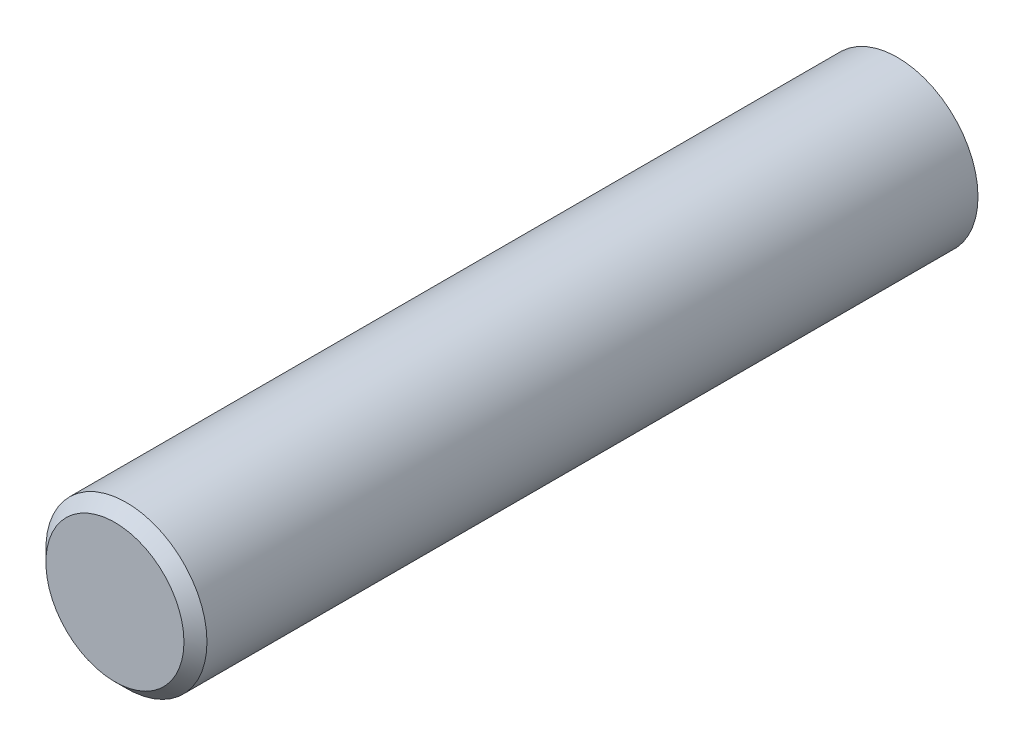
ISO-10303-21;
HEADER;
FILE_DESCRIPTION(('STEP AP214'),'2;1');
FILE_NAME('part.step','',(''),(''),'','','');
FILE_SCHEMA(('AUTOMOTIVE_DESIGN { 1 0 10303 214 1 1 1 1 }'));
ENDSEC;
DATA;
#1=APPLICATION_CONTEXT('core data for automotive mechanical design processes');
#2=APPLICATION_PROTOCOL_DEFINITION('international standard','automotive_design',2000,#1);
#3=PRODUCT_CONTEXT('',#1,'mechanical');
#4=PRODUCT('Part','Part','',(#3));
#5=PRODUCT_RELATED_PRODUCT_CATEGORY('part','',(#4));
#6=PRODUCT_DEFINITION_FORMATION('','',#4);
#7=PRODUCT_DEFINITION_CONTEXT('part definition',#1,'design');
#8=PRODUCT_DEFINITION('design','',#6,#7);
#9=PRODUCT_DEFINITION_SHAPE('','',#8);
#10=(LENGTH_UNIT() NAMED_UNIT(*) SI_UNIT(.MILLI.,.METRE.));
#11=(NAMED_UNIT(*) PLANE_ANGLE_UNIT() SI_UNIT($,.RADIAN.));
#12=(NAMED_UNIT(*) SI_UNIT($,.STERADIAN.) SOLID_ANGLE_UNIT());
#13=UNCERTAINTY_MEASURE_WITH_UNIT(LENGTH_MEASURE(1.E-05),#10,'distance_accuracy_value','');
#14=(GEOMETRIC_REPRESENTATION_CONTEXT(3) GLOBAL_UNCERTAINTY_ASSIGNED_CONTEXT((#13)) GLOBAL_UNIT_ASSIGNED_CONTEXT((#10,
#11,#12)) REPRESENTATION_CONTEXT('',''));
#15=CARTESIAN_POINT('',(0.,0.,0.));
#16=DIRECTION('',(0.,0.,1.));
#17=DIRECTION('',(1.,0.,0.));
#18=AXIS2_PLACEMENT_3D('',#15,#16,#17);
#19=CARTESIAN_POINT('',(0.,0.,34.));
#20=DIRECTION('',(0.,0.,-1.));
#21=DIRECTION('',(-1.,0.,0.));
#22=AXIS2_PLACEMENT_3D('',#19,#20,#21);
#23=CYLINDRICAL_SURFACE('',#22,3.5);
#24=CARTESIAN_POINT('',(0.,0.,33.5));
#25=DIRECTION('',(0.,0.,1.));
#26=DIRECTION('',(1.,0.,0.));
#27=AXIS2_PLACEMENT_3D('',#24,#25,#26);
#28=CIRCLE('',#27,3.5);
#29=CARTESIAN_POINT('',(3.5,0.,33.5));
#30=VERTEX_POINT('',#29);
#31=EDGE_CURVE('E10',#30,#30,#28,.F.);
#32=ORIENTED_EDGE('',*,*,#31,.T.);
#33=EDGE_LOOP('',(#32));
#34=FACE_BOUND('',#33,.T.);
#35=CARTESIAN_POINT('',(0.,0.,0.));
#36=DIRECTION('',(0.,0.,1.));
#37=DIRECTION('',(1.,0.,0.));
#38=AXIS2_PLACEMENT_3D('',#35,#36,#37);
#39=CIRCLE('',#38,3.5);
#40=CARTESIAN_POINT('',(3.5,0.,0.));
#41=VERTEX_POINT('',#40);
#42=EDGE_CURVE('E41',#41,#41,#39,.T.);
#43=ORIENTED_EDGE('',*,*,#42,.T.);
#44=EDGE_LOOP('',(#43));
#45=FACE_BOUND('',#44,.T.);
#46=ADVANCED_FACE('F30',(#34,#45),#23,.T.);
#47=CARTESIAN_POINT('',(0.,0.,34.));
#48=DIRECTION('',(0.,0.,1.));
#49=DIRECTION('',(1.,0.,0.));
#50=AXIS2_PLACEMENT_3D('',#47,#48,#49);
#51=PLANE('',#50);
#52=CARTESIAN_POINT('',(0.,0.,34.));
#53=DIRECTION('',(0.,0.,1.));
#54=DIRECTION('',(1.,0.,0.));
#55=AXIS2_PLACEMENT_3D('',#52,#53,#54);
#56=CIRCLE('',#55,2.99999999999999);
#57=CARTESIAN_POINT('',(2.99999999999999,0.,34.));
#58=VERTEX_POINT('',#57);
#59=EDGE_CURVE('E37',#58,#58,#56,.T.);
#60=ORIENTED_EDGE('',*,*,#59,.T.);
#61=EDGE_LOOP('',(#60));
#62=FACE_BOUND('',#61,.T.);
#63=ADVANCED_FACE('F51',(#62),#51,.T.);
#64=CARTESIAN_POINT('',(0.,0.,0.));
#65=DIRECTION('',(0.,0.,1.));
#66=DIRECTION('',(1.,0.,0.));
#67=AXIS2_PLACEMENT_3D('',#64,#65,#66);
#68=PLANE('',#67);
#69=ORIENTED_EDGE('',*,*,#42,.F.);
#70=EDGE_LOOP('',(#69));
#71=FACE_BOUND('',#70,.T.);
#72=ADVANCED_FACE('F49',(#71),#68,.F.);
#73=CARTESIAN_POINT('',(0.,0.,34.));
#74=DIRECTION('',(0.,0.,-1.));
#75=DIRECTION('',(-1.,0.,0.));
#76=AXIS2_PLACEMENT_3D('',#73,#74,#75);
#77=CONICAL_SURFACE('',#76,2.99999999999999,0.785398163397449);
#78=ORIENTED_EDGE('',*,*,#31,.F.);
#79=EDGE_LOOP('',(#78));
#80=FACE_BOUND('',#79,.T.);
#81=ORIENTED_EDGE('',*,*,#59,.F.);
#82=EDGE_LOOP('',(#81));
#83=FACE_BOUND('',#82,.T.);
#84=ADVANCED_FACE('F32',(#80,#83),#77,.T.);
#85=CLOSED_SHELL('',(#46,#63,#72,#84));
#86=MANIFOLD_SOLID_BREP('B2',#85);
#87=ADVANCED_BREP_SHAPE_REPRESENTATION('',(#18,#86),#14);
#88=SHAPE_DEFINITION_REPRESENTATION(#9,#87);
ENDSEC;
END-ISO-10303-21;
